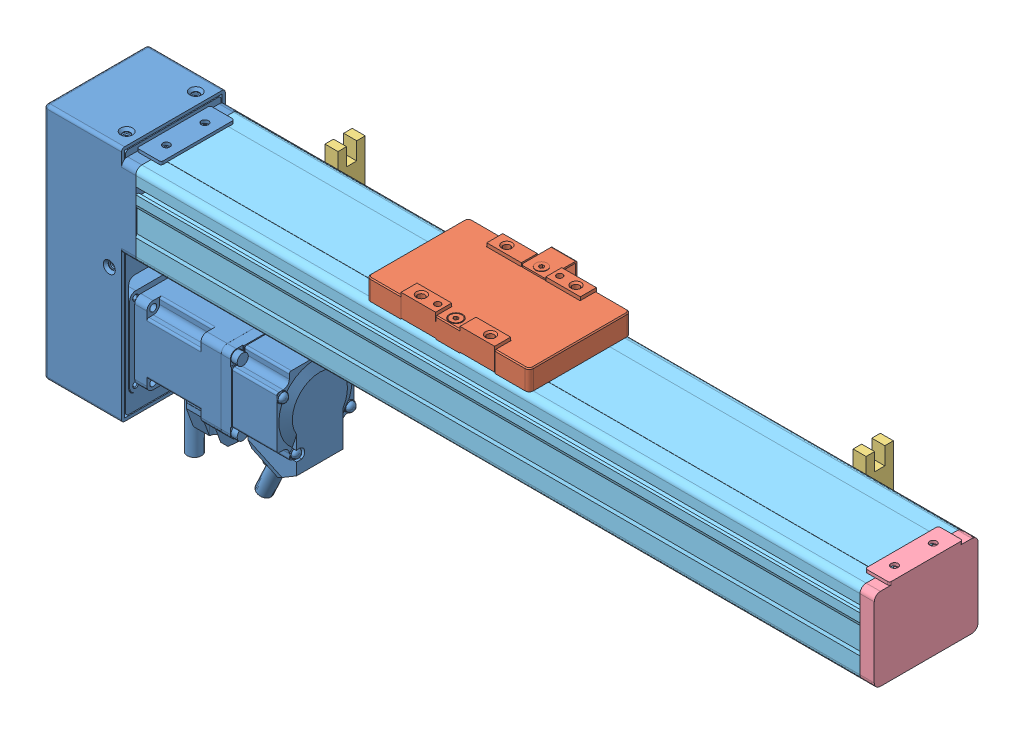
SolidWorks assembly TCD50-P-J2-0.SLDASM, configuration 250 (file format 9000). Lengths in mm.
Overall size (408.32 145 64.4).
6 component instances, 5 part files, 16 mates.
Components (placement in the parent):
- TCD50-P-J2-1-1: TCD50-P-J2-1.sldprt [默认] at origin
- TCD50-P-J2-2-1: TCD50-P-J2-2.sldprt [默认] at (-152.0976 0 0)
- TCD50-P-J2-3-1: TCD50-P-J2-3.sldprt [默认] at (-404.7 0 0)
- TCD50-P-J2-4-1: TCD50-P-J2-4.sldprt [默认] at (-150 0 0)
- TCD50-P-J2-5-1: TCD50-P-J2-5.SLDPRT [250] at (-578.3345 -1.5 0) x (0 0 -1) z (1 0 0) size (51 42.1 356)
- TCD50-P-J2-3-2: TCD50-P-J2-3.sldprt [默认] at (-145.1 0 0)
Mates (geometry in assembly coordinates):
- 重合7: coincident aligned: plane of TCD50-P-J2-1-1 through (-600.0845 -13 -25.5) normal (0 0 -1); plane of TCD50-P-J2-5-1 through (-222.3345 32.7 -25.5) normal (0 0 -1)
- 重合8: coincident anti-aligned: plane of TCD50-P-J2-1-1 through (-578.3345 19.5 0) normal (1 0 0); plane of TCD50-P-J2-5-1 through (-578.3345 37.5 -22.5) normal (-1 0 0)
- 重合9: coincident aligned: plane of TCD50-P-J2-1-1 through (-581.8345 40.5 -19.75) normal (0 1 0); plane of TCD50-P-J2-5-1 through (-222.3345 40.5 -22.5) normal (0 1 0)
- 重合10: coincident anti-aligned: plane of TCD50-P-J2-4-1 through (-222.3345 19.5 0) normal (-1 0 0); plane of TCD50-P-J2-5-1 through (-222.3345 37.5 -22.5) normal (1 0 0)
- 重合11: coincident aligned: plane of TCD50-P-J2-4-1 through (-218.8345 20.25 25.5) normal (0 0 1); plane of TCD50-P-J2-5-1 through (-222.3345 29.3 25.5) normal (0 0 1)
- 重合12: coincident aligned: plane of TCD50-P-J2-4-1 through (-218.8345 40.5 19.75) normal (0 1 0); plane of TCD50-P-J2-5-1 through (-222.3345 40.5 15) normal (0 1 0)
- 距离3: distance = 0.5 mm aligned: plane of TCD50-P-J2-2-1 through (-425.4321 46.75 25) normal (0 0 1); plane of TCD50-P-J2-5-1 through (-222.3345 29.3 25.5) normal (0 0 1)
- 距离4: distance = 54 mm anti-aligned: plane of TCD50-P-J2-5-1 through (-222.3345 -1.5 11.5) normal (0 -1 0); plane of TCD50-P-J2-2-1 through (-439.9321 52.5 21.075) normal (0 1 0)
- 距离5: distance = 6.4 mm aligned: plane of TCD50-P-J2-5-1 through (-222.3345 40.5 -22.5) normal (0 1 0); plane of TCD50-P-J2-3-1 through (-525.0345 34.1 -27) normal (0 1 0)
- 重合13: coincident anti-aligned: plane of TCD50-P-J2-3-1 through (-533.1345 33.3 -25.5) normal (0 0 1); plane of TCD50-P-J2-5-1 through (-222.3345 32.7 -25.5) normal (0 0 -1)
- LimitDistance1: limit distance = 170.0976 mm aligned: plane of TCD50-P-J2-2-1 through (-385.4321 45.75 0) normal (1 0 0); plane of TCD50-P-J2-4-1 through (-215.3345 21 0) normal (1 0 0)
- LimitDistance2: limit distance = 157.9024 mm aligned: plane of TCD50-P-J2-1-1 through (-623.3345 -13 0) normal (-1 0 0); plane of TCD50-P-J2-2-1 through (-465.4321 45.75 0) normal (-1 0 0)
- 重合16: coincident aligned: plane of TCD50-P-J2-3-1 through (-525.0345 31 -28.5) normal (0 0 -1); plane of TCD50-P-J2-3-2 through (-265.4345 31 -28.5) normal (0 0 -1)
- 重合17: coincident aligned: plane of TCD50-P-J2-3-1 through (-525.0345 34.1 -27) normal (0 1 0); plane of TCD50-P-J2-3-2 through (-265.4345 34.1 -27) normal (0 1 0)
- 距离6: distance = 87 mm aligned: plane of TCD50-P-J2-3-1 through (-536.3345 33.3 -32.2) normal (-1 0 0); plane of TCD50-P-J2-1-1 through (-623.3345 -13 0) normal (-1 0 0)
- 距离7: distance = 55 mm aligned: plane of TCD50-P-J2-3-2 through (-270.3345 33.3 -32.2) normal (1 0 0); plane of TCD50-P-J2-4-1 through (-215.3345 21 0) normal (1 0 0)
